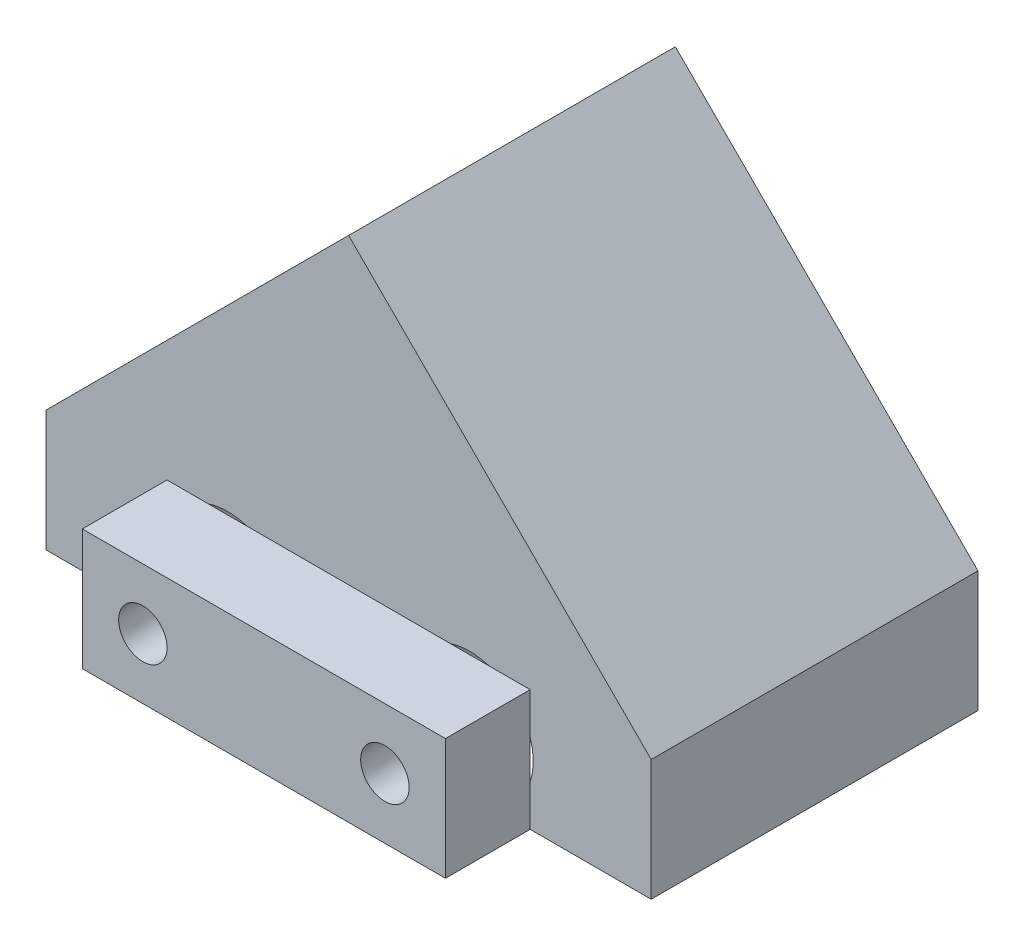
from build123d import *

# Parameters (mm, degrees)
ESQUISSE1_W             = 50
ESQUISSE1_H             = 35
BOSS_EXTRU_1_DEPTH      = 27
ENL_V_MAT_EXTRU_1_DEPTH = 27
ENL_V_MAT_EXTRU_2_DEPTH = 27
ESQUISSE4_W             = 30
ESQUISSE4_H             = 10
ESQUISSE4_R             = 2
BOSS_EXTRU_2_DEPTH      = 7
ESQUISSE5_R             = 5.25
ENL_V_MAT_EXTRU_3_DEPTH = 33


with BuildPart() as part:
    # Esquisse1 → Boss.-Extru.1 (new body)
    with BuildSketch(Plane.XY):
        with Locations((25, 17.5)):
            Rectangle(ESQUISSE1_W, ESQUISSE1_H)
    extrude(amount=BOSS_EXTRU_1_DEPTH)

    # Esquisse2 → Enl_v. mat.-Extru.1 (cut)
    with BuildSketch(Plane(origin=(0, 0, 0), x_dir=(-1, 0, 0), z_dir=(0, 0, -1))):
        Polygon((-25, 35), (-50, 10), (-50, 35), align=None)
    extrude(amount=-ENL_V_MAT_EXTRU_1_DEPTH, mode=Mode.SUBTRACT)

    # Esquisse3 → Enl_v. mat.-Extru.2 (cut)
    with BuildSketch(Plane(origin=(0, 0, 0), x_dir=(-1, 0, 0), z_dir=(0, 0, -1))):
        Polygon((-25, 35), (0, 10), (0, 35), align=None)
    extrude(amount=-ENL_V_MAT_EXTRU_2_DEPTH, mode=Mode.SUBTRACT)

    # Esquisse4 → Boss.-Extru.2 (add)
    with BuildSketch(Plane.XY.offset(27)):
        with Locations((25, 5)):
            Rectangle(ESQUISSE4_W, ESQUISSE4_H)
        with Locations((15, 5)):
            Circle(ESQUISSE4_R, mode=Mode.SUBTRACT)
        with Locations((35, 5)):
            Circle(ESQUISSE4_R, mode=Mode.SUBTRACT)
    extrude(amount=BOSS_EXTRU_2_DEPTH)

    # Esquisse5 → Enl_v. mat.-Extru.3 (cut)
    with BuildSketch(Plane.XY.offset(27)):
        with Locations((15, 5)):
            Circle(ESQUISSE5_R)
        with Locations((35, 5)):
            Circle(ESQUISSE5_R)
    extrude(amount=-ENL_V_MAT_EXTRU_3_DEPTH, mode=Mode.SUBTRACT)


solid = part.part
